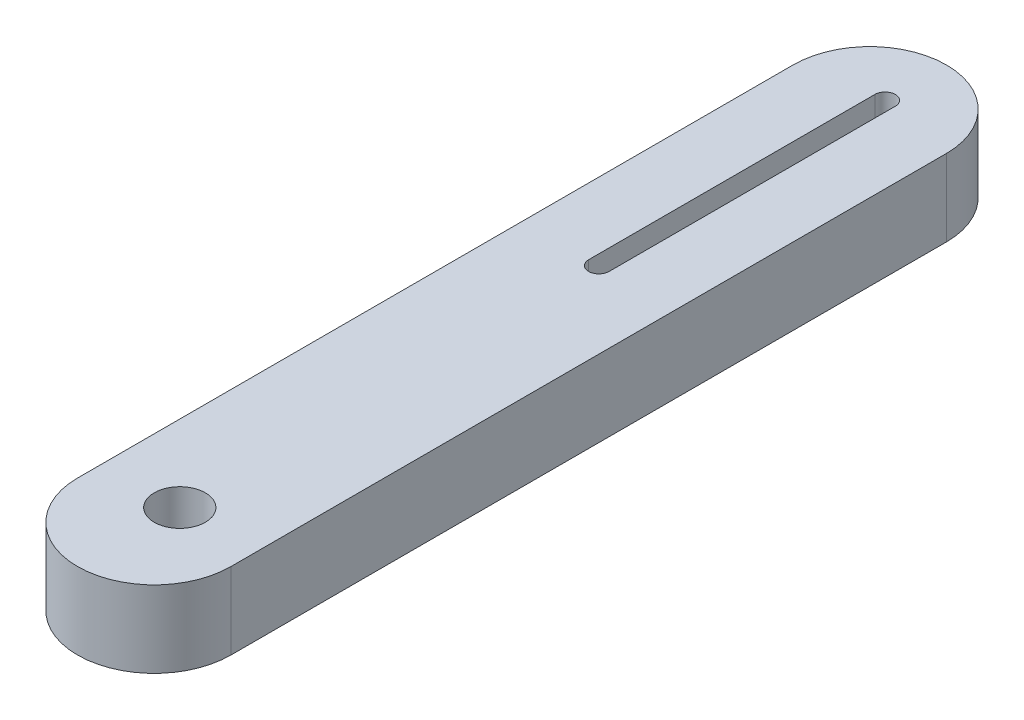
ISO-10303-21;
HEADER;
FILE_DESCRIPTION(('STEP AP214'),'2;1');
FILE_NAME('part.step','',(''),(''),'','','');
FILE_SCHEMA(('AUTOMOTIVE_DESIGN { 1 0 10303 214 1 1 1 1 }'));
ENDSEC;
DATA;
#1=APPLICATION_CONTEXT('core data for automotive mechanical design processes');
#2=APPLICATION_PROTOCOL_DEFINITION('international standard','automotive_design',2000,#1);
#3=PRODUCT_CONTEXT('',#1,'mechanical');
#4=PRODUCT('Part','Part','',(#3));
#5=PRODUCT_RELATED_PRODUCT_CATEGORY('part','',(#4));
#6=PRODUCT_DEFINITION_FORMATION('','',#4);
#7=PRODUCT_DEFINITION_CONTEXT('part definition',#1,'design');
#8=PRODUCT_DEFINITION('design','',#6,#7);
#9=PRODUCT_DEFINITION_SHAPE('','',#8);
#10=(LENGTH_UNIT() NAMED_UNIT(*) SI_UNIT(.MILLI.,.METRE.));
#11=(NAMED_UNIT(*) PLANE_ANGLE_UNIT() SI_UNIT($,.RADIAN.));
#12=(NAMED_UNIT(*) SI_UNIT($,.STERADIAN.) SOLID_ANGLE_UNIT());
#13=UNCERTAINTY_MEASURE_WITH_UNIT(LENGTH_MEASURE(1.E-05),#10,'distance_accuracy_value','');
#14=(GEOMETRIC_REPRESENTATION_CONTEXT(3) GLOBAL_UNCERTAINTY_ASSIGNED_CONTEXT((#13)) GLOBAL_UNIT_ASSIGNED_CONTEXT((#10,
#11,#12)) REPRESENTATION_CONTEXT('',''));
#15=CARTESIAN_POINT('',(0.,0.,0.));
#16=DIRECTION('',(0.,0.,1.));
#17=DIRECTION('',(1.,0.,0.));
#18=AXIS2_PLACEMENT_3D('',#15,#16,#17);
#19=CARTESIAN_POINT('',(19.05,-9.52500000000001,76.2));
#20=DIRECTION('',(-1.,0.,0.));
#21=DIRECTION('',(0.,-1.,0.));
#22=AXIS2_PLACEMENT_3D('',#19,#20,#21);
#23=PLANE('',#22);
#24=DIRECTION('',(0.,1.,0.));
#25=VECTOR('',#24,1.);
#26=CARTESIAN_POINT('',(19.05,-9.52505000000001,184.15));
#27=LINE('',#26,#25);
#28=CARTESIAN_POINT('',(19.05,-9.52500000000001,184.15));
#29=VERTEX_POINT('',#28);
#30=CARTESIAN_POINT('',(19.05,9.525,184.15));
#31=VERTEX_POINT('',#30);
#32=EDGE_CURVE('E142',#29,#31,#27,.T.);
#33=ORIENTED_EDGE('',*,*,#32,.F.);
#34=DIRECTION('',(0.,0.,-1.));
#35=VECTOR('',#34,1.);
#36=CARTESIAN_POINT('',(19.05,-9.52500000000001,76.2));
#37=LINE('',#36,#35);
#38=CARTESIAN_POINT('',(19.05,-9.52500000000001,6.35));
#39=VERTEX_POINT('',#38);
#40=EDGE_CURVE('E151',#29,#39,#37,.T.);
#41=ORIENTED_EDGE('',*,*,#40,.T.);
#42=DIRECTION('',(0.,1.,0.));
#43=VECTOR('',#42,1.);
#44=CARTESIAN_POINT('',(19.05,-9.52505000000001,6.35));
#45=LINE('',#44,#43);
#46=CARTESIAN_POINT('',(19.05,9.525,6.35));
#47=VERTEX_POINT('',#46);
#48=EDGE_CURVE('E134',#39,#47,#45,.T.);
#49=ORIENTED_EDGE('',*,*,#48,.T.);
#50=DIRECTION('',(0.,0.,-1.));
#51=VECTOR('',#50,1.);
#52=CARTESIAN_POINT('',(19.05,9.525,76.2));
#53=LINE('',#52,#51);
#54=EDGE_CURVE('E149',#31,#47,#53,.T.);
#55=ORIENTED_EDGE('',*,*,#54,.F.);
#56=EDGE_LOOP('',(#33,#41,#49,#55));
#57=FACE_BOUND('',#56,.T.);
#58=ADVANCED_FACE('F36',(#57),#23,.F.);
#59=CARTESIAN_POINT('',(-19.05,9.52500000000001,76.2));
#60=DIRECTION('',(0.,-1.,0.));
#61=DIRECTION('',(1.,0.,0.));
#62=AXIS2_PLACEMENT_3D('',#59,#60,#61);
#63=PLANE('',#62);
#64=CARTESIAN_POINT('',(0.,9.525,177.8));
#65=DIRECTION('',(0.,1.,0.));
#66=DIRECTION('',(-1.,0.,0.));
#67=AXIS2_PLACEMENT_3D('',#64,#65,#66);
#68=CIRCLE('',#67,6.35);
#69=CARTESIAN_POINT('',(-6.34999999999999,9.525,177.8));
#70=VERTEX_POINT('',#69);
#71=EDGE_CURVE('E259',#70,#70,#68,.T.);
#72=ORIENTED_EDGE('',*,*,#71,.F.);
#73=EDGE_LOOP('',(#72));
#74=FACE_BOUND('',#73,.T.);
#75=DIRECTION('',(0.,0.,1.));
#76=VECTOR('',#75,1.);
#77=CARTESIAN_POINT('',(-2.54,9.525,2.54));
#78=LINE('',#77,#76);
#79=CARTESIAN_POINT('',(-2.54,9.525,2.54));
#80=VERTEX_POINT('',#79);
#81=CARTESIAN_POINT('',(-2.53999999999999,9.525,73.66));
#82=VERTEX_POINT('',#81);
#83=EDGE_CURVE('E256',#80,#82,#78,.T.);
#84=ORIENTED_EDGE('',*,*,#83,.F.);
#85=CARTESIAN_POINT('',(0.,9.525,2.54));
#86=DIRECTION('',(0.,1.,0.));
#87=DIRECTION('',(0.,0.,1.));
#88=AXIS2_PLACEMENT_3D('',#85,#86,#87);
#89=CIRCLE('',#88,2.54);
#90=CARTESIAN_POINT('',(2.54,9.525,2.54));
#91=VERTEX_POINT('',#90);
#92=EDGE_CURVE('E51',#91,#80,#89,.T.);
#93=ORIENTED_EDGE('',*,*,#92,.F.);
#94=DIRECTION('',(0.,0.,-1.));
#95=VECTOR('',#94,1.);
#96=CARTESIAN_POINT('',(2.54,9.525,2.54));
#97=LINE('',#96,#95);
#98=CARTESIAN_POINT('',(2.54000000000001,9.525,73.66));
#99=VERTEX_POINT('',#98);
#100=EDGE_CURVE('E246',#99,#91,#97,.T.);
#101=ORIENTED_EDGE('',*,*,#100,.F.);
#102=CARTESIAN_POINT('',(0.,9.525,73.66));
#103=DIRECTION('',(0.,1.,0.));
#104=DIRECTION('',(0.,0.,1.));
#105=AXIS2_PLACEMENT_3D('',#102,#103,#104);
#106=CIRCLE('',#105,2.54);
#107=EDGE_CURVE('E253',#82,#99,#106,.T.);
#108=ORIENTED_EDGE('',*,*,#107,.F.);
#109=EDGE_LOOP('',(#84,#93,#101,#108));
#110=FACE_BOUND('',#109,.T.);
#111=CARTESIAN_POINT('',(0.,9.525,184.15));
#112=DIRECTION('',(0.,1.,0.));
#113=DIRECTION('',(-1.,0.,0.));
#114=AXIS2_PLACEMENT_3D('',#111,#112,#113);
#115=CIRCLE('',#114,19.05);
#116=CARTESIAN_POINT('',(-19.05,9.525,184.15));
#117=VERTEX_POINT('',#116);
#118=EDGE_CURVE('E143',#117,#31,#115,.T.);
#119=ORIENTED_EDGE('',*,*,#118,.T.);
#120=ORIENTED_EDGE('',*,*,#54,.T.);
#121=CARTESIAN_POINT('',(0.,9.525,6.34999999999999));
#122=DIRECTION('',(0.,1.,0.));
#123=DIRECTION('',(-1.,0.,0.));
#124=AXIS2_PLACEMENT_3D('',#121,#122,#123);
#125=CIRCLE('',#124,19.05);
#126=CARTESIAN_POINT('',(-19.05,9.525,6.34999999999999));
#127=VERTEX_POINT('',#126);
#128=EDGE_CURVE('E131',#47,#127,#125,.T.);
#129=ORIENTED_EDGE('',*,*,#128,.T.);
#130=DIRECTION('',(0.,0.,-1.));
#131=VECTOR('',#130,1.);
#132=CARTESIAN_POINT('',(-19.05,9.52500000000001,76.2));
#133=LINE('',#132,#131);
#134=EDGE_CURVE('E155',#117,#127,#133,.T.);
#135=ORIENTED_EDGE('',*,*,#134,.F.);
#136=EDGE_LOOP('',(#119,#120,#129,#135));
#137=FACE_BOUND('',#136,.T.);
#138=ADVANCED_FACE('F153',(#74,#110,#137),#63,.F.);
#139=CARTESIAN_POINT('',(-19.05,-9.52500000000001,76.2));
#140=DIRECTION('',(1.,0.,0.));
#141=DIRECTION('',(0.,0.,-1.));
#142=AXIS2_PLACEMENT_3D('',#139,#140,#141);
#143=PLANE('',#142);
#144=DIRECTION('',(0.,0.,-1.));
#145=VECTOR('',#144,1.);
#146=CARTESIAN_POINT('',(-19.05,-9.52500000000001,76.2));
#147=LINE('',#146,#145);
#148=CARTESIAN_POINT('',(-19.05,-9.525,184.15));
#149=VERTEX_POINT('',#148);
#150=CARTESIAN_POINT('',(-19.05,-9.525,6.34999999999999));
#151=VERTEX_POINT('',#150);
#152=EDGE_CURVE('E159',#149,#151,#147,.T.);
#153=ORIENTED_EDGE('',*,*,#152,.F.);
#154=DIRECTION('',(0.,1.,0.));
#155=VECTOR('',#154,1.);
#156=CARTESIAN_POINT('',(-19.05,-9.52505000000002,184.15));
#157=LINE('',#156,#155);
#158=EDGE_CURVE('E266',#149,#117,#157,.T.);
#159=ORIENTED_EDGE('',*,*,#158,.T.);
#160=ORIENTED_EDGE('',*,*,#134,.T.);
#161=DIRECTION('',(0.,1.,0.));
#162=VECTOR('',#161,1.);
#163=CARTESIAN_POINT('',(-19.05,-9.52505000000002,6.34999999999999));
#164=LINE('',#163,#162);
#165=EDGE_CURVE('E137',#151,#127,#164,.T.);
#166=ORIENTED_EDGE('',*,*,#165,.F.);
#167=EDGE_LOOP('',(#153,#159,#160,#166));
#168=FACE_BOUND('',#167,.T.);
#169=ADVANCED_FACE('F273',(#168),#143,.F.);
#170=CARTESIAN_POINT('',(6.35,-9.525,76.2));
#171=DIRECTION('',(0.,1.,0.));
#172=DIRECTION('',(-1.,0.,0.));
#173=AXIS2_PLACEMENT_3D('',#170,#171,#172);
#174=PLANE('',#173);
#175=CARTESIAN_POINT('',(0.,-9.525,177.8));
#176=DIRECTION('',(0.,1.,0.));
#177=DIRECTION('',(-1.,0.,0.));
#178=AXIS2_PLACEMENT_3D('',#175,#176,#177);
#179=CIRCLE('',#178,6.35);
#180=CARTESIAN_POINT('',(-6.34999999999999,-9.525,177.8));
#181=VERTEX_POINT('',#180);
#182=EDGE_CURVE('E39',#181,#181,#179,.T.);
#183=ORIENTED_EDGE('',*,*,#182,.T.);
#184=EDGE_LOOP('',(#183));
#185=FACE_BOUND('',#184,.T.);
#186=DIRECTION('',(0.,0.,-1.));
#187=VECTOR('',#186,1.);
#188=CARTESIAN_POINT('',(6.35,-9.525,76.2));
#189=LINE('',#188,#187);
#190=CARTESIAN_POINT('',(6.34999999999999,-9.52500000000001,76.2));
#191=VERTEX_POINT('',#190);
#192=CARTESIAN_POINT('',(6.35,-9.52500000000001,0.));
#193=VERTEX_POINT('',#192);
#194=EDGE_CURVE('E163',#191,#193,#189,.T.);
#195=ORIENTED_EDGE('',*,*,#194,.T.);
#196=DIRECTION('',(-1.,0.,0.));
#197=VECTOR('',#196,1.);
#198=CARTESIAN_POINT('',(19.05,-9.52500000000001,0.));
#199=LINE('',#198,#197);
#200=CARTESIAN_POINT('',(-6.35,-9.52500000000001,0.));
#201=VERTEX_POINT('',#200);
#202=EDGE_CURVE('E219',#193,#201,#199,.T.);
#203=ORIENTED_EDGE('',*,*,#202,.T.);
#204=DIRECTION('',(0.,0.,-1.));
#205=VECTOR('',#204,1.);
#206=CARTESIAN_POINT('',(-6.35,-9.525,76.2));
#207=LINE('',#206,#205);
#208=CARTESIAN_POINT('',(-6.35,-9.525,76.2));
#209=VERTEX_POINT('',#208);
#210=EDGE_CURVE('E174',#209,#201,#207,.T.);
#211=ORIENTED_EDGE('',*,*,#210,.F.);
#212=DIRECTION('',(1.,0.,0.));
#213=VECTOR('',#212,1.);
#214=CARTESIAN_POINT('',(-19.05,-9.52500000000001,76.2));
#215=LINE('',#214,#213);
#216=EDGE_CURVE('E197',#209,#191,#215,.T.);
#217=ORIENTED_EDGE('',*,*,#216,.T.);
#218=EDGE_LOOP('',(#195,#203,#211,#217));
#219=FACE_BOUND('',#218,.T.);
#220=CARTESIAN_POINT('',(0.,-9.525,184.15));
#221=DIRECTION('',(0.,1.,0.));
#222=DIRECTION('',(-1.,0.,0.));
#223=AXIS2_PLACEMENT_3D('',#220,#221,#222);
#224=CIRCLE('',#223,19.05);
#225=EDGE_CURVE('E262',#149,#29,#224,.T.);
#226=ORIENTED_EDGE('',*,*,#225,.F.);
#227=ORIENTED_EDGE('',*,*,#152,.T.);
#228=CARTESIAN_POINT('',(0.,-9.525,6.34999999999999));
#229=DIRECTION('',(0.,1.,0.));
#230=DIRECTION('',(-1.,0.,0.));
#231=AXIS2_PLACEMENT_3D('',#228,#229,#230);
#232=CIRCLE('',#231,19.05);
#233=EDGE_CURVE('E264',#39,#151,#232,.T.);
#234=ORIENTED_EDGE('',*,*,#233,.F.);
#235=ORIENTED_EDGE('',*,*,#40,.F.);
#236=EDGE_LOOP('',(#226,#227,#234,#235));
#237=FACE_BOUND('',#236,.T.);
#238=ADVANCED_FACE('F279',(#185,#219,#237),#174,.F.);
#239=CARTESIAN_POINT('',(-6.35,3.17499999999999,76.2));
#240=DIRECTION('',(0.,1.,0.));
#241=DIRECTION('',(-1.,0.,0.));
#242=AXIS2_PLACEMENT_3D('',#239,#240,#241);
#243=PLANE('',#242);
#244=CARTESIAN_POINT('',(0.,3.175,73.66));
#245=DIRECTION('',(0.,1.,0.));
#246=DIRECTION('',(-1.,0.,0.));
#247=AXIS2_PLACEMENT_3D('',#244,#245,#246);
#248=CIRCLE('',#247,2.54);
#249=CARTESIAN_POINT('',(0.,3.175,76.2));
#250=VERTEX_POINT('',#249);
#251=CARTESIAN_POINT('',(2.54000000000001,3.175,73.66));
#252=VERTEX_POINT('',#251);
#253=EDGE_CURVE('E220',#250,#252,#248,.T.);
#254=ORIENTED_EDGE('',*,*,#253,.T.);
#255=DIRECTION('',(0.,0.,-1.));
#256=VECTOR('',#255,1.);
#257=CARTESIAN_POINT('',(2.54000000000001,3.175,76.2));
#258=LINE('',#257,#256);
#259=CARTESIAN_POINT('',(2.54,3.175,2.54));
#260=VERTEX_POINT('',#259);
#261=EDGE_CURVE('E12',#252,#260,#258,.T.);
#262=ORIENTED_EDGE('',*,*,#261,.T.);
#263=CARTESIAN_POINT('',(0.,3.175,2.54));
#264=DIRECTION('',(0.,1.,0.));
#265=DIRECTION('',(-1.,0.,0.));
#266=AXIS2_PLACEMENT_3D('',#263,#264,#265);
#267=CIRCLE('',#266,2.54);
#268=CARTESIAN_POINT('',(0.,3.175,0.));
#269=VERTEX_POINT('',#268);
#270=EDGE_CURVE('E240',#260,#269,#267,.T.);
#271=ORIENTED_EDGE('',*,*,#270,.T.);
#272=DIRECTION('',(1.,0.,0.));
#273=VECTOR('',#272,1.);
#274=CARTESIAN_POINT('',(-6.35,3.17499999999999,0.));
#275=LINE('',#274,#273);
#276=CARTESIAN_POINT('',(6.35,3.175,0.));
#277=VERTEX_POINT('',#276);
#278=EDGE_CURVE('E184',#269,#277,#275,.T.);
#279=ORIENTED_EDGE('',*,*,#278,.T.);
#280=DIRECTION('',(0.,0.,-1.));
#281=VECTOR('',#280,1.);
#282=CARTESIAN_POINT('',(6.35,3.175,76.2));
#283=LINE('',#282,#281);
#284=CARTESIAN_POINT('',(6.35,3.175,76.2));
#285=VERTEX_POINT('',#284);
#286=EDGE_CURVE('E166',#285,#277,#283,.T.);
#287=ORIENTED_EDGE('',*,*,#286,.F.);
#288=DIRECTION('',(1.,0.,0.));
#289=VECTOR('',#288,1.);
#290=CARTESIAN_POINT('',(-6.35,3.17499999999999,76.2));
#291=LINE('',#290,#289);
#292=EDGE_CURVE('E201',#250,#285,#291,.T.);
#293=ORIENTED_EDGE('',*,*,#292,.F.);
#294=EDGE_LOOP('',(#254,#262,#271,#279,#287,#293));
#295=FACE_BOUND('',#294,.T.);
#296=ADVANCED_FACE('F224',(#295),#243,.F.);
#297=CARTESIAN_POINT('',(-6.35,-9.525,76.2));
#298=DIRECTION('',(-1.,0.,0.));
#299=DIRECTION('',(0.,-1.,0.));
#300=AXIS2_PLACEMENT_3D('',#297,#298,#299);
#301=PLANE('',#300);
#302=DIRECTION('',(0.,1.,0.));
#303=VECTOR('',#302,1.);
#304=CARTESIAN_POINT('',(-6.35,-9.525,0.));
#305=LINE('',#304,#303);
#306=CARTESIAN_POINT('',(-6.35,3.17499999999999,0.));
#307=VERTEX_POINT('',#306);
#308=EDGE_CURVE('E194',#201,#307,#305,.T.);
#309=ORIENTED_EDGE('',*,*,#308,.T.);
#310=DIRECTION('',(0.,0.,-1.));
#311=VECTOR('',#310,1.);
#312=CARTESIAN_POINT('',(-6.35,3.17499999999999,76.2));
#313=LINE('',#312,#311);
#314=CARTESIAN_POINT('',(-6.35,3.17499999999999,76.2));
#315=VERTEX_POINT('',#314);
#316=EDGE_CURVE('E215',#315,#307,#313,.T.);
#317=ORIENTED_EDGE('',*,*,#316,.F.);
#318=DIRECTION('',(0.,1.,0.));
#319=VECTOR('',#318,1.);
#320=CARTESIAN_POINT('',(-6.35,-9.525,76.2));
#321=LINE('',#320,#319);
#322=EDGE_CURVE('E191',#209,#315,#321,.T.);
#323=ORIENTED_EDGE('',*,*,#322,.F.);
#324=ORIENTED_EDGE('',*,*,#210,.T.);
#325=EDGE_LOOP('',(#309,#317,#323,#324));
#326=FACE_BOUND('',#325,.T.);
#327=ADVANCED_FACE('F283',(#326),#301,.F.);
#328=EDGE_CURVE('E180',#307,#269,#275,.T.);
#329=ORIENTED_EDGE('',*,*,#328,.T.);
#330=CARTESIAN_POINT('',(-2.54,3.175,2.54));
#331=VERTEX_POINT('',#330);
#332=EDGE_CURVE('E241',#269,#331,#267,.T.);
#333=ORIENTED_EDGE('',*,*,#332,.T.);
#334=DIRECTION('',(0.,0.,1.));
#335=VECTOR('',#334,1.);
#336=CARTESIAN_POINT('',(-2.53999999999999,3.175,76.2));
#337=LINE('',#336,#335);
#338=CARTESIAN_POINT('',(-2.53999999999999,3.175,73.66));
#339=VERTEX_POINT('',#338);
#340=EDGE_CURVE('E44',#331,#339,#337,.T.);
#341=ORIENTED_EDGE('',*,*,#340,.T.);
#342=EDGE_CURVE('E216',#339,#250,#248,.T.);
#343=ORIENTED_EDGE('',*,*,#342,.T.);
#344=EDGE_CURVE('E173',#315,#250,#291,.T.);
#345=ORIENTED_EDGE('',*,*,#344,.F.);
#346=ORIENTED_EDGE('',*,*,#316,.T.);
#347=EDGE_LOOP('',(#329,#333,#341,#343,#345,#346));
#348=FACE_BOUND('',#347,.T.);
#349=ADVANCED_FACE('F214',(#348),#243,.F.);
#350=CARTESIAN_POINT('',(6.35,-9.525,76.2));
#351=DIRECTION('',(1.,0.,0.));
#352=DIRECTION('',(0.,1.,0.));
#353=AXIS2_PLACEMENT_3D('',#350,#351,#352);
#354=PLANE('',#353);
#355=DIRECTION('',(0.,-1.,0.));
#356=VECTOR('',#355,1.);
#357=CARTESIAN_POINT('',(6.35,-9.525,0.));
#358=LINE('',#357,#356);
#359=EDGE_CURVE('E183',#277,#193,#358,.T.);
#360=ORIENTED_EDGE('',*,*,#359,.T.);
#361=ORIENTED_EDGE('',*,*,#194,.F.);
#362=DIRECTION('',(0.,-1.,0.));
#363=VECTOR('',#362,1.);
#364=CARTESIAN_POINT('',(6.35,-9.525,76.2));
#365=LINE('',#364,#363);
#366=EDGE_CURVE('E169',#285,#191,#365,.T.);
#367=ORIENTED_EDGE('',*,*,#366,.F.);
#368=ORIENTED_EDGE('',*,*,#286,.T.);
#369=EDGE_LOOP('',(#360,#361,#367,#368));
#370=FACE_BOUND('',#369,.T.);
#371=ADVANCED_FACE('F232',(#370),#354,.F.);
#372=CARTESIAN_POINT('',(0.,0.,76.2));
#373=DIRECTION('',(0.,0.,1.));
#374=DIRECTION('',(1.,0.,0.));
#375=AXIS2_PLACEMENT_3D('',#372,#373,#374);
#376=PLANE('',#375);
#377=ORIENTED_EDGE('',*,*,#366,.T.);
#378=ORIENTED_EDGE('',*,*,#216,.F.);
#379=ORIENTED_EDGE('',*,*,#322,.T.);
#380=ORIENTED_EDGE('',*,*,#344,.T.);
#381=ORIENTED_EDGE('',*,*,#292,.T.);
#382=EDGE_LOOP('',(#377,#378,#379,#380,#381));
#383=FACE_BOUND('',#382,.T.);
#384=ADVANCED_FACE('F210',(#383),#376,.F.);
#385=CARTESIAN_POINT('',(0.,0.,0.));
#386=DIRECTION('',(0.,0.,-1.));
#387=DIRECTION('',(-1.,0.,0.));
#388=AXIS2_PLACEMENT_3D('',#385,#386,#387);
#389=PLANE('',#388);
#390=ORIENTED_EDGE('',*,*,#308,.F.);
#391=ORIENTED_EDGE('',*,*,#202,.F.);
#392=ORIENTED_EDGE('',*,*,#359,.F.);
#393=ORIENTED_EDGE('',*,*,#278,.F.);
#394=ORIENTED_EDGE('',*,*,#328,.F.);
#395=EDGE_LOOP('',(#390,#391,#392,#393,#394));
#396=FACE_BOUND('',#395,.T.);
#397=ADVANCED_FACE('F286',(#396),#389,.F.);
#398=CARTESIAN_POINT('',(2.54,-9.52505000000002,2.54));
#399=DIRECTION('',(1.,0.,0.));
#400=DIRECTION('',(0.,1.,0.));
#401=AXIS2_PLACEMENT_3D('',#398,#399,#400);
#402=PLANE('',#401);
#403=DIRECTION('',(0.,1.,0.));
#404=VECTOR('',#403,1.);
#405=CARTESIAN_POINT('',(2.54000000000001,-9.52505000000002,73.66));
#406=LINE('',#405,#404);
#407=EDGE_CURVE('E248',#252,#99,#406,.T.);
#408=ORIENTED_EDGE('',*,*,#407,.T.);
#409=ORIENTED_EDGE('',*,*,#100,.T.);
#410=DIRECTION('',(0.,1.,0.));
#411=VECTOR('',#410,1.);
#412=CARTESIAN_POINT('',(2.54,-9.52505000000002,2.54));
#413=LINE('',#412,#411);
#414=EDGE_CURVE('E243',#260,#91,#413,.T.);
#415=ORIENTED_EDGE('',*,*,#414,.F.);
#416=ORIENTED_EDGE('',*,*,#261,.F.);
#417=EDGE_LOOP('',(#408,#409,#415,#416));
#418=FACE_BOUND('',#417,.T.);
#419=ADVANCED_FACE('F291',(#418),#402,.F.);
#420=CARTESIAN_POINT('',(-2.54,-9.52505000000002,2.54));
#421=DIRECTION('',(-1.,0.,0.));
#422=DIRECTION('',(0.,-1.,0.));
#423=AXIS2_PLACEMENT_3D('',#420,#421,#422);
#424=PLANE('',#423);
#425=DIRECTION('',(0.,1.,0.));
#426=VECTOR('',#425,1.);
#427=CARTESIAN_POINT('',(-2.54,-9.52505000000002,2.54));
#428=LINE('',#427,#426);
#429=EDGE_CURVE('E244',#331,#80,#428,.T.);
#430=ORIENTED_EDGE('',*,*,#429,.T.);
#431=ORIENTED_EDGE('',*,*,#83,.T.);
#432=DIRECTION('',(0.,1.,0.));
#433=VECTOR('',#432,1.);
#434=CARTESIAN_POINT('',(-2.53999999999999,-9.52505000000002,73.66));
#435=LINE('',#434,#433);
#436=EDGE_CURVE('E59',#339,#82,#435,.T.);
#437=ORIENTED_EDGE('',*,*,#436,.F.);
#438=ORIENTED_EDGE('',*,*,#340,.F.);
#439=EDGE_LOOP('',(#430,#431,#437,#438));
#440=FACE_BOUND('',#439,.T.);
#441=ADVANCED_FACE('F297',(#440),#424,.F.);
#442=CARTESIAN_POINT('',(0.,-9.52505000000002,73.66));
#443=DIRECTION('',(0.,1.,0.));
#444=DIRECTION('',(-1.,0.,0.));
#445=AXIS2_PLACEMENT_3D('',#442,#443,#444);
#446=CYLINDRICAL_SURFACE('',#445,2.54);
#447=ORIENTED_EDGE('',*,*,#436,.T.);
#448=ORIENTED_EDGE('',*,*,#107,.T.);
#449=ORIENTED_EDGE('',*,*,#407,.F.);
#450=ORIENTED_EDGE('',*,*,#253,.F.);
#451=ORIENTED_EDGE('',*,*,#342,.F.);
#452=EDGE_LOOP('',(#447,#448,#449,#450,#451));
#453=FACE_BOUND('',#452,.T.);
#454=ADVANCED_FACE('F292',(#453),#446,.F.);
#455=CARTESIAN_POINT('',(0.,-9.52505000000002,2.54));
#456=DIRECTION('',(0.,1.,0.));
#457=DIRECTION('',(-1.,0.,0.));
#458=AXIS2_PLACEMENT_3D('',#455,#456,#457);
#459=CYLINDRICAL_SURFACE('',#458,2.54);
#460=ORIENTED_EDGE('',*,*,#414,.T.);
#461=ORIENTED_EDGE('',*,*,#92,.T.);
#462=ORIENTED_EDGE('',*,*,#429,.F.);
#463=ORIENTED_EDGE('',*,*,#332,.F.);
#464=ORIENTED_EDGE('',*,*,#270,.F.);
#465=EDGE_LOOP('',(#460,#461,#462,#463,#464));
#466=FACE_BOUND('',#465,.T.);
#467=ADVANCED_FACE('F287',(#466),#459,.F.);
#468=CARTESIAN_POINT('',(0.,-9.52505000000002,177.8));
#469=DIRECTION('',(0.,1.,0.));
#470=DIRECTION('',(-1.,0.,0.));
#471=AXIS2_PLACEMENT_3D('',#468,#469,#470);
#472=CYLINDRICAL_SURFACE('',#471,6.35);
#473=CARTESIAN_POINT('',(-6.34999999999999,9.525,177.8));
#474=CARTESIAN_POINT('',(-6.34999999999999,9.3265625,177.8));
#475=CARTESIAN_POINT('',(-6.34999999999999,9.128125,177.8));
#476=CARTESIAN_POINT('',(-6.34999999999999,8.73125,177.8));
#477=CARTESIAN_POINT('',(-6.34999999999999,8.5328125,177.8));
#478=CARTESIAN_POINT('',(-6.34999999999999,8.1359375,177.8));
#479=CARTESIAN_POINT('',(-6.34999999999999,7.9375,177.8));
#480=CARTESIAN_POINT('',(-6.34999999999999,7.540625,177.8));
#481=CARTESIAN_POINT('',(-6.34999999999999,7.3421875,177.8));
#482=CARTESIAN_POINT('',(-6.34999999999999,6.9453125,177.8));
#483=CARTESIAN_POINT('',(-6.34999999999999,6.746875,177.8));
#484=CARTESIAN_POINT('',(-6.34999999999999,6.35,177.8));
#485=CARTESIAN_POINT('',(-6.34999999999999,6.1515625,177.8));
#486=CARTESIAN_POINT('',(-6.34999999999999,5.7546875,177.8));
#487=CARTESIAN_POINT('',(-6.34999999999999,5.55625,177.8));
#488=CARTESIAN_POINT('',(-6.34999999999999,5.159375,177.8));
#489=CARTESIAN_POINT('',(-6.34999999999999,4.9609375,177.8));
#490=CARTESIAN_POINT('',(-6.34999999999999,4.5640625,177.8));
#491=CARTESIAN_POINT('',(-6.34999999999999,4.365625,177.8));
#492=CARTESIAN_POINT('',(-6.34999999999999,3.96875,177.8));
#493=CARTESIAN_POINT('',(-6.34999999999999,3.7703125,177.8));
#494=CARTESIAN_POINT('',(-6.34999999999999,3.3734375,177.8));
#495=CARTESIAN_POINT('',(-6.34999999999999,3.175,177.8));
#496=CARTESIAN_POINT('',(-6.34999999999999,2.778125,177.8));
#497=CARTESIAN_POINT('',(-6.34999999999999,2.5796875,177.8));
#498=CARTESIAN_POINT('',(-6.34999999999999,2.1828125,177.8));
#499=CARTESIAN_POINT('',(-6.34999999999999,1.984375,177.8));
#500=CARTESIAN_POINT('',(-6.34999999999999,1.5875,177.8));
#501=CARTESIAN_POINT('',(-6.34999999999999,1.3890625,177.8));
#502=CARTESIAN_POINT('',(-6.34999999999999,0.992187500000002,177.8));
#503=CARTESIAN_POINT('',(-6.34999999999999,0.793750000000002,177.8));
#504=CARTESIAN_POINT('',(-6.34999999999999,0.396875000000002,177.8));
#505=CARTESIAN_POINT('',(-6.34999999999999,0.198437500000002,177.8));
#506=CARTESIAN_POINT('',(-6.34999999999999,-0.198437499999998,177.8));
#507=CARTESIAN_POINT('',(-6.34999999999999,-0.396874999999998,177.8));
#508=CARTESIAN_POINT('',(-6.34999999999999,-0.793749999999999,177.8));
#509=CARTESIAN_POINT('',(-6.34999999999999,-0.992187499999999,177.8));
#510=CARTESIAN_POINT('',(-6.34999999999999,-1.3890625,177.8));
#511=CARTESIAN_POINT('',(-6.34999999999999,-1.5875,177.8));
#512=CARTESIAN_POINT('',(-6.34999999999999,-1.984375,177.8));
#513=CARTESIAN_POINT('',(-6.34999999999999,-2.1828125,177.8));
#514=CARTESIAN_POINT('',(-6.34999999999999,-2.5796875,177.8));
#515=CARTESIAN_POINT('',(-6.34999999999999,-2.778125,177.8));
#516=CARTESIAN_POINT('',(-6.34999999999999,-3.175,177.8));
#517=CARTESIAN_POINT('',(-6.34999999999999,-3.3734375,177.8));
#518=CARTESIAN_POINT('',(-6.34999999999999,-3.7703125,177.8));
#519=CARTESIAN_POINT('',(-6.34999999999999,-3.96875,177.8));
#520=CARTESIAN_POINT('',(-6.34999999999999,-4.365625,177.8));
#521=CARTESIAN_POINT('',(-6.34999999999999,-4.5640625,177.8));
#522=CARTESIAN_POINT('',(-6.34999999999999,-4.9609375,177.8));
#523=CARTESIAN_POINT('',(-6.34999999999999,-5.159375,177.8));
#524=CARTESIAN_POINT('',(-6.34999999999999,-5.55625,177.8));
#525=CARTESIAN_POINT('',(-6.34999999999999,-5.7546875,177.8));
#526=CARTESIAN_POINT('',(-6.34999999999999,-6.1515625,177.8));
#527=CARTESIAN_POINT('',(-6.34999999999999,-6.35,177.8));
#528=CARTESIAN_POINT('',(-6.34999999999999,-6.74687499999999,177.8));
#529=CARTESIAN_POINT('',(-6.34999999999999,-6.9453125,177.8));
#530=CARTESIAN_POINT('',(-6.34999999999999,-7.3421875,177.8));
#531=CARTESIAN_POINT('',(-6.34999999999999,-7.540625,177.8));
#532=CARTESIAN_POINT('',(-6.34999999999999,-7.9375,177.8));
#533=CARTESIAN_POINT('',(-6.34999999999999,-8.1359375,177.8));
#534=CARTESIAN_POINT('',(-6.34999999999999,-8.5328125,177.8));
#535=CARTESIAN_POINT('',(-6.34999999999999,-8.73125,177.8));
#536=CARTESIAN_POINT('',(-6.34999999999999,-9.128125,177.8));
#537=CARTESIAN_POINT('',(-6.34999999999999,-9.3265625,177.8));
#538=CARTESIAN_POINT('',(-6.34999999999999,-9.525,177.8));
#539=B_SPLINE_CURVE_WITH_KNOTS('',3,(#473,#474,#475,#476,#477,#478,#479,#480,#481,#482,#483,
#484,#485,#486,#487,#488,#489,#490,#491,#492,#493,#494,#495,#496,#497,#498,#499,#500,#501,#502,
#503,#504,#505,#506,#507,#508,#509,#510,#511,#512,#513,#514,#515,#516,#517,#518,#519,#520,#521,
#522,#523,#524,#525,#526,#527,#528,#529,#530,#531,#532,#533,#534,#535,#536,#537,#538),
.UNSPECIFIED.,.F.,.F.,(4,2,2,2,2,2,2,2,2,2,2,2,2,2,2,2,2,2,2,2,2,2,2,2,2,2,2,2,2,2,2,2,4),(0.,
0.5953125,1.190625,1.7859375,2.38125,2.9765625,3.571875,4.1671875,4.7625,5.3578125,5.953125,
6.5484375,7.14375,7.7390625,8.334375,8.9296875,9.525,10.1203125,10.715625,11.3109375,11.90625,
12.5015625,13.096875,13.6921875,14.2875,14.8828125,15.478125,16.0734375,16.66875,17.2640625,
17.859375,18.4546875,19.05),.UNSPECIFIED.);
#540=EDGE_CURVE('BSEAM331',#70,#181,#539,.T.);
#541=ORIENTED_EDGE('',*,*,#71,.T.);
#542=ORIENTED_EDGE('',*,*,#182,.F.);
#543=ORIENTED_EDGE('',*,*,#540,.T.);
#544=ORIENTED_EDGE('',*,*,#540,.F.);
#545=EDGE_LOOP('',(#541,#543,#542,#544));
#546=FACE_BOUND('',#545,.T.);
#547=ADVANCED_FACE('F331',(#546),#472,.F.);
#548=CARTESIAN_POINT('',(0.,-9.52505000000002,6.34999999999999));
#549=DIRECTION('',(0.,1.,0.));
#550=DIRECTION('',(-1.,0.,0.));
#551=AXIS2_PLACEMENT_3D('',#548,#549,#550);
#552=CYLINDRICAL_SURFACE('',#551,19.05);
#553=ORIENTED_EDGE('',*,*,#233,.T.);
#554=ORIENTED_EDGE('',*,*,#165,.T.);
#555=ORIENTED_EDGE('',*,*,#128,.F.);
#556=ORIENTED_EDGE('',*,*,#48,.F.);
#557=EDGE_LOOP('',(#553,#554,#555,#556));
#558=FACE_BOUND('',#557,.T.);
#559=ADVANCED_FACE('F133',(#558),#552,.T.);
#560=CARTESIAN_POINT('',(0.,-9.52505000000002,184.15));
#561=DIRECTION('',(0.,1.,0.));
#562=DIRECTION('',(-1.,0.,0.));
#563=AXIS2_PLACEMENT_3D('',#560,#561,#562);
#564=CYLINDRICAL_SURFACE('',#563,19.05);
#565=ORIENTED_EDGE('',*,*,#225,.T.);
#566=ORIENTED_EDGE('',*,*,#32,.T.);
#567=ORIENTED_EDGE('',*,*,#118,.F.);
#568=ORIENTED_EDGE('',*,*,#158,.F.);
#569=EDGE_LOOP('',(#565,#566,#567,#568));
#570=FACE_BOUND('',#569,.T.);
#571=ADVANCED_FACE('F277',(#570),#564,.T.);
#572=CLOSED_SHELL('',(#58,#138,#169,#238,#296,#327,#349,#371,#384,#397,#419,#441,#454,#467,#547,
#559,#571));
#573=MANIFOLD_SOLID_BREP('B2',#572);
#574=ADVANCED_BREP_SHAPE_REPRESENTATION('',(#18,#573),#14);
#575=SHAPE_DEFINITION_REPRESENTATION(#9,#574);
ENDSEC;
END-ISO-10303-21;
